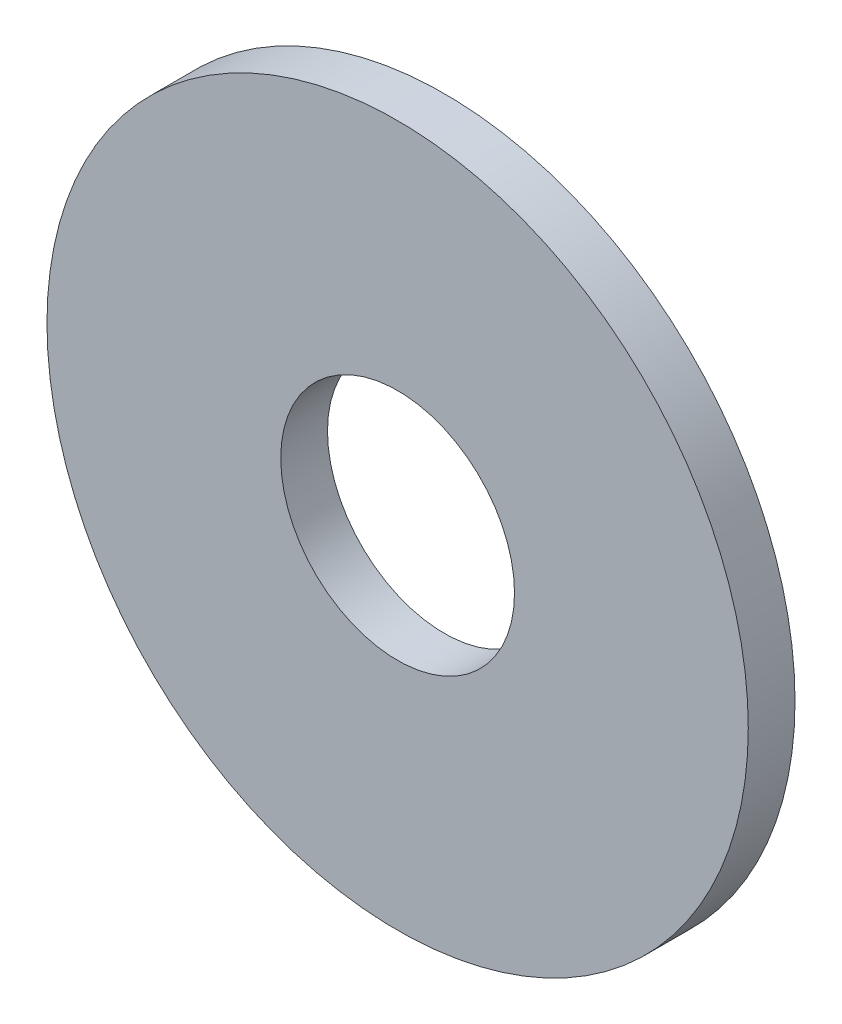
ISO-10303-21;
HEADER;
FILE_DESCRIPTION(('STEP AP214'),'2;1');
FILE_NAME('part.step','',(''),(''),'','','');
FILE_SCHEMA(('AUTOMOTIVE_DESIGN { 1 0 10303 214 1 1 1 1 }'));
ENDSEC;
DATA;
#1=APPLICATION_CONTEXT('core data for automotive mechanical design processes');
#2=APPLICATION_PROTOCOL_DEFINITION('international standard','automotive_design',2000,#1);
#3=PRODUCT_CONTEXT('',#1,'mechanical');
#4=PRODUCT('Part','Part','',(#3));
#5=PRODUCT_RELATED_PRODUCT_CATEGORY('part','',(#4));
#6=PRODUCT_DEFINITION_FORMATION('','',#4);
#7=PRODUCT_DEFINITION_CONTEXT('part definition',#1,'design');
#8=PRODUCT_DEFINITION('design','',#6,#7);
#9=PRODUCT_DEFINITION_SHAPE('','',#8);
#10=(LENGTH_UNIT() NAMED_UNIT(*) SI_UNIT(.MILLI.,.METRE.));
#11=(NAMED_UNIT(*) PLANE_ANGLE_UNIT() SI_UNIT($,.RADIAN.));
#12=(NAMED_UNIT(*) SI_UNIT($,.STERADIAN.) SOLID_ANGLE_UNIT());
#13=UNCERTAINTY_MEASURE_WITH_UNIT(LENGTH_MEASURE(1.E-05),#10,'distance_accuracy_value','');
#14=(GEOMETRIC_REPRESENTATION_CONTEXT(3) GLOBAL_UNCERTAINTY_ASSIGNED_CONTEXT((#13)) GLOBAL_UNIT_ASSIGNED_CONTEXT((#10,
#11,#12)) REPRESENTATION_CONTEXT('',''));
#15=CARTESIAN_POINT('',(0.,0.,0.));
#16=DIRECTION('',(0.,0.,1.));
#17=DIRECTION('',(1.,0.,0.));
#18=AXIS2_PLACEMENT_3D('',#15,#16,#17);
#19=CARTESIAN_POINT('',(0.,0.,1.2));
#20=DIRECTION('',(0.,0.,1.));
#21=DIRECTION('',(1.,0.,0.));
#22=AXIS2_PLACEMENT_3D('',#19,#20,#21);
#23=PLANE('',#22);
#24=CARTESIAN_POINT('',(0.,0.,1.2));
#25=DIRECTION('',(0.,0.,1.));
#26=DIRECTION('',(1.,0.,0.));
#27=AXIS2_PLACEMENT_3D('',#24,#25,#26);
#28=CIRCLE('',#27,9.);
#29=CARTESIAN_POINT('',(9.,0.,1.2));
#30=VERTEX_POINT('',#29);
#31=EDGE_CURVE('E10',#30,#30,#28,.T.);
#32=ORIENTED_EDGE('',*,*,#31,.T.);
#33=EDGE_LOOP('',(#32));
#34=FACE_BOUND('',#33,.T.);
#35=CARTESIAN_POINT('',(0.,0.,1.2));
#36=DIRECTION('',(0.,0.,1.));
#37=DIRECTION('',(1.,0.,0.));
#38=AXIS2_PLACEMENT_3D('',#35,#36,#37);
#39=CIRCLE('',#38,3.);
#40=CARTESIAN_POINT('',(3.,0.,1.2));
#41=VERTEX_POINT('',#40);
#42=EDGE_CURVE('E35',#41,#41,#39,.T.);
#43=ORIENTED_EDGE('',*,*,#42,.F.);
#44=EDGE_LOOP('',(#43));
#45=FACE_BOUND('',#44,.T.);
#46=ADVANCED_FACE('F24',(#34,#45),#23,.T.);
#47=CARTESIAN_POINT('',(0.,0.,0.));
#48=DIRECTION('',(0.,0.,1.));
#49=DIRECTION('',(1.,0.,0.));
#50=AXIS2_PLACEMENT_3D('',#47,#48,#49);
#51=PLANE('',#50);
#52=CARTESIAN_POINT('',(0.,0.,0.));
#53=DIRECTION('',(0.,0.,1.));
#54=DIRECTION('',(1.,0.,0.));
#55=AXIS2_PLACEMENT_3D('',#52,#53,#54);
#56=CIRCLE('',#55,9.);
#57=CARTESIAN_POINT('',(9.,0.,0.));
#58=VERTEX_POINT('',#57);
#59=EDGE_CURVE('E31',#58,#58,#56,.T.);
#60=ORIENTED_EDGE('',*,*,#59,.F.);
#61=EDGE_LOOP('',(#60));
#62=FACE_BOUND('',#61,.T.);
#63=CARTESIAN_POINT('',(0.,0.,0.));
#64=DIRECTION('',(0.,0.,1.));
#65=DIRECTION('',(1.,0.,0.));
#66=AXIS2_PLACEMENT_3D('',#63,#64,#65);
#67=CIRCLE('',#66,3.);
#68=CARTESIAN_POINT('',(3.,0.,0.));
#69=VERTEX_POINT('',#68);
#70=EDGE_CURVE('E39',#69,#69,#67,.T.);
#71=ORIENTED_EDGE('',*,*,#70,.T.);
#72=EDGE_LOOP('',(#71));
#73=FACE_BOUND('',#72,.T.);
#74=ADVANCED_FACE('F45',(#62,#73),#51,.F.);
#75=CARTESIAN_POINT('',(0.,0.,1.2));
#76=DIRECTION('',(0.,0.,-1.));
#77=DIRECTION('',(-1.,0.,0.));
#78=AXIS2_PLACEMENT_3D('',#75,#76,#77);
#79=CYLINDRICAL_SURFACE('',#78,9.);
#80=ORIENTED_EDGE('',*,*,#31,.F.);
#81=EDGE_LOOP('',(#80));
#82=FACE_BOUND('',#81,.T.);
#83=ORIENTED_EDGE('',*,*,#59,.T.);
#84=EDGE_LOOP('',(#83));
#85=FACE_BOUND('',#84,.T.);
#86=ADVANCED_FACE('F26',(#82,#85),#79,.T.);
#87=CARTESIAN_POINT('',(0.,0.,1.2));
#88=DIRECTION('',(0.,0.,-1.));
#89=DIRECTION('',(-1.,0.,0.));
#90=AXIS2_PLACEMENT_3D('',#87,#88,#89);
#91=CYLINDRICAL_SURFACE('',#90,3.);
#92=ORIENTED_EDGE('',*,*,#42,.T.);
#93=EDGE_LOOP('',(#92));
#94=FACE_BOUND('',#93,.T.);
#95=ORIENTED_EDGE('',*,*,#70,.F.);
#96=EDGE_LOOP('',(#95));
#97=FACE_BOUND('',#96,.T.);
#98=ADVANCED_FACE('F47',(#94,#97),#91,.F.);
#99=CLOSED_SHELL('',(#46,#74,#86,#98));
#100=MANIFOLD_SOLID_BREP('B2',#99);
#101=ADVANCED_BREP_SHAPE_REPRESENTATION('',(#18,#100),#14);
#102=SHAPE_DEFINITION_REPRESENTATION(#9,#101);
ENDSEC;
END-ISO-10303-21;
